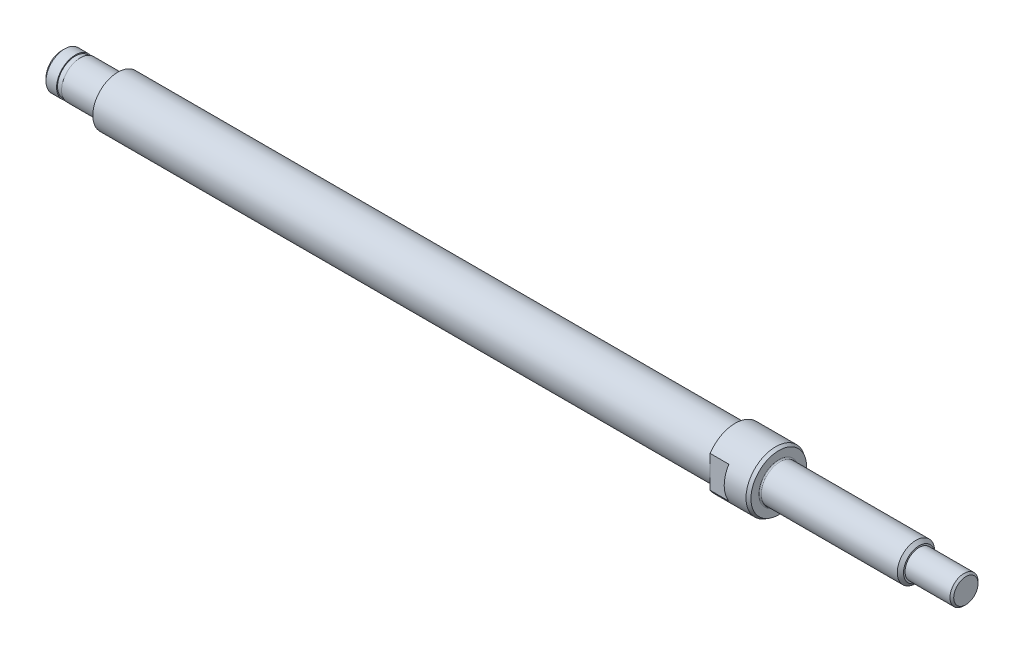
from build123d import *

# Parameters (mm, degrees)
SKETCH3_W          = 16
SKETCH3_H          = 19
SKETCH3_W_2        = 8
SKETCH3_H_2        = 9.7
CUT_EXTRUDE1_DEPTH = 3


with BuildPart() as part:
    # Sketch1 → Revolve1 (revolve)
    with BuildSketch(Plane.XY, mode=Mode.PRIVATE) as revolve1_sk:
        with BuildLine():
            Line((0, 0), (0, 4))
            Line((0, 4), (99, 4))
            Line((99, 4), (99, 4.75))
            Line((99, 4.75), (105.5, 4.75))
            Line((105.5, 4.75), (106, 4.461324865))
            Line((106, 4.461324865), (106, 3.2))
            ThreePointArc((106, 3.2), (106.058578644, 3.058578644), (106.2, 3))
            Line((106.2, 3), (128, 3))
            Line((128, 3), (128.5, 2.5))
            Line((128.5, 2.5), (128.5, 2.25))
            Line((128.5, 2.25), (135.7, 2.25))
            Line((135.7, 2.25), (136, 1.95))
            Line((136, 1.95), (136, 0))
            Line((136, 0), (0, 0))
        make_face()
    revolve(revolve1_sk.sketch.rotate(Axis((136, 0, 0), (-1, 0, 0)), 270), axis=Axis((136, 0, 0), (-1, 0, 0)))

    # Sketch2 → Revolve2 (revolve)
    with BuildSketch(Plane.XY, mode=Mode.PRIVATE) as revolve2_sk:
        with BuildLine():
            Line((-9, 0), (-9, 2.5))
            Line((-9, 2.5), (-8.5, 3))
            Line((-8.5, 3), (-6.8, 3))
            Line((-6.8, 3), (-6.8, 2.85))
            Line((-6.8, 2.85), (-6, 2.85))
            Line((-6, 2.85), (-6, 3))
            Line((-6, 3), (-0.2, 3))
            ThreePointArc((-0.2, 3), (-0.058578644, 3.058578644), (0, 3.2))
            Line((0, 3.2), (0, 0))
            Line((0, 0), (-9, 0))
        make_face()
    revolve(revolve2_sk.sketch.rotate(Axis((0, 0, 0), (-1, 0, 0)), 270), axis=Axis((0, 0, 0), (-1, 0, 0)))

    # Sketch3 → Cut-Extrude1 (cut)
    with BuildSketch(Plane(origin=(102, 0, 0), x_dir=(0, 0, -1), z_dir=(1, 0, 0))):
        Rectangle(SKETCH3_W, SKETCH3_H)
        Rectangle(SKETCH3_W_2, SKETCH3_H_2, mode=Mode.SUBTRACT)
    extrude(amount=-CUT_EXTRUDE1_DEPTH, mode=Mode.SUBTRACT)


solid = part.part
